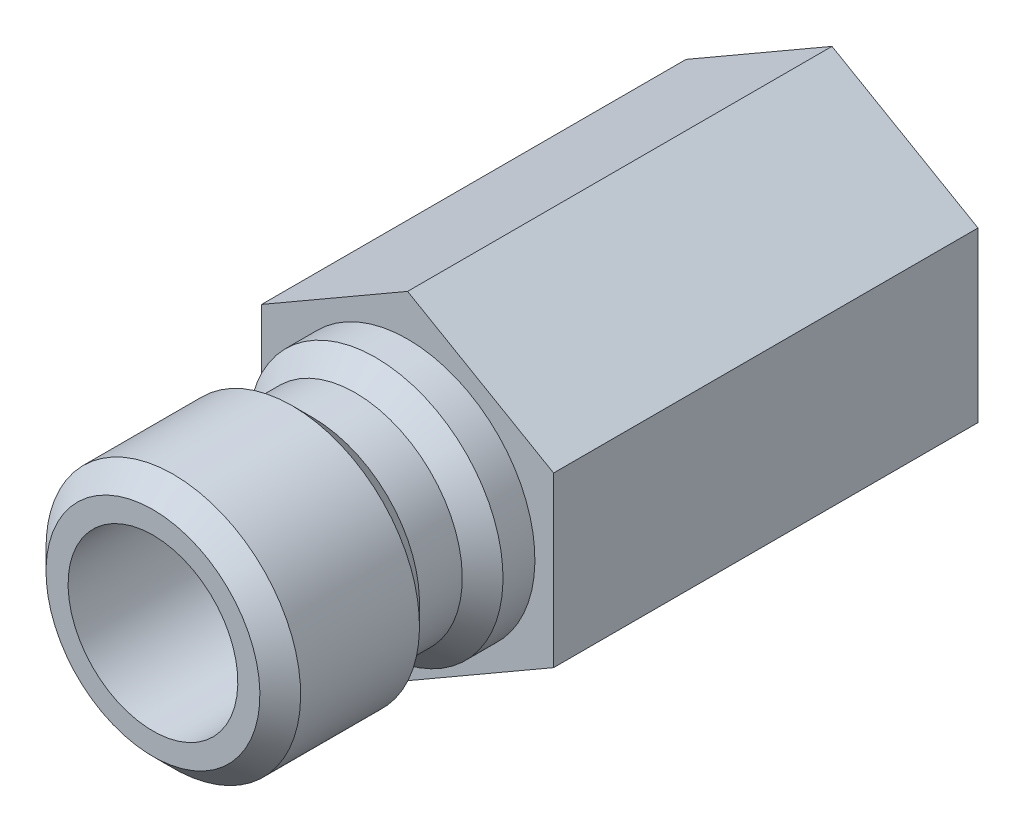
from build123d import *

# Parameters (mm, degrees)
SKETCH2_OUTSIDE_W  = 20.922
SKETCH2_OUTSIDE_H  = 20.922
CUT_EXTRUDE1_DEPTH = 19.238986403


with BuildPart() as part:
    # Sketch1 → Revolve1 (revolve)
    with BuildSketch(Plane(origin=(0, 0, 0), x_dir=(0, 0, -1), z_dir=(1, 0, 0))):
        Polygon((-9.525, 3.175), (-9.525, 4.0005), (-8.763, 4.7625), (-4.318, 4.7625), (-3.556, 4.0005), (-1.9558, 4.0005), (-1.1938, 4.7625), (0, 4.7625), (0, 6.35), (15.875, 6.35), (15.875, 4.602954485), (6.35, 4.3053), (6.35, 3.175), align=None)
    revolve(axis=Axis((0, 0, 0), (0, 0, 1)))

    # Sketch2 outside → Cut-Extrude1 (cut, through all)
    with BuildSketch(Plane.XY):
        Rectangle(SKETCH2_OUTSIDE_W, SKETCH2_OUTSIDE_H)
        Polygon((-5.461, 3.15290982), (-5.461, -3.15290982), (0, -6.30581964), (5.461, -3.15290982), (5.461, 3.15290982), (0, 6.30581964), align=None, mode=Mode.SUBTRACT)
    extrude(amount=-CUT_EXTRUDE1_DEPTH, mode=Mode.SUBTRACT)


solid = part.part
